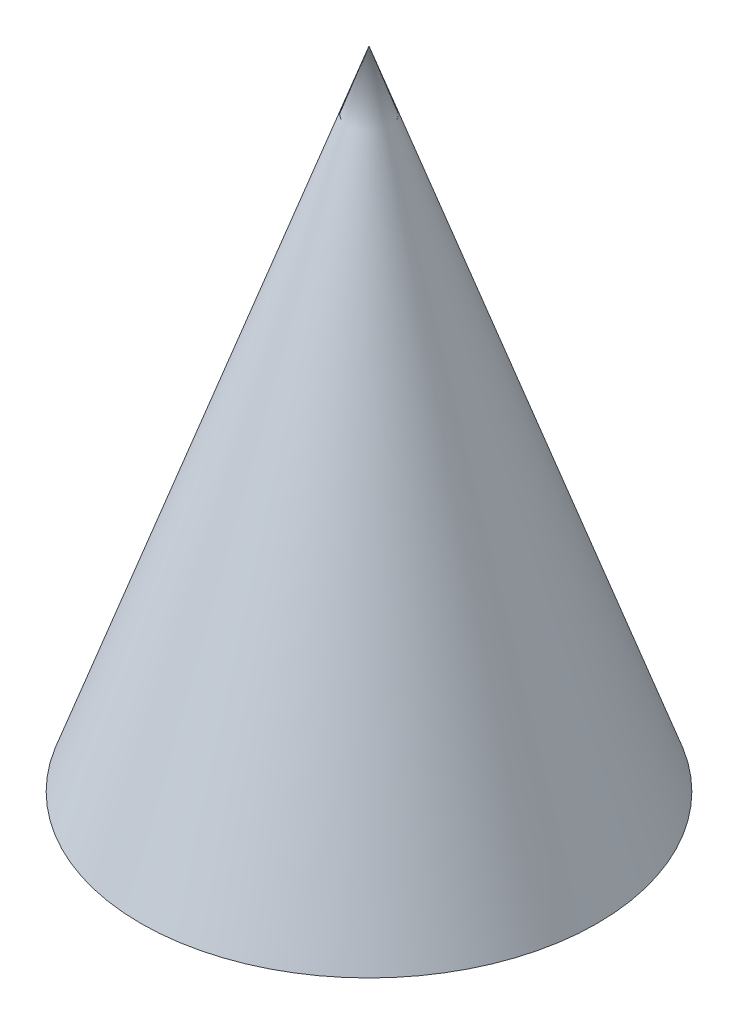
ISO-10303-21;
HEADER;
FILE_DESCRIPTION(('STEP AP214'),'2;1');
FILE_NAME('part.step','',(''),(''),'','','');
FILE_SCHEMA(('AUTOMOTIVE_DESIGN { 1 0 10303 214 1 1 1 1 }'));
ENDSEC;
DATA;
#1=APPLICATION_CONTEXT('core data for automotive mechanical design processes');
#2=APPLICATION_PROTOCOL_DEFINITION('international standard','automotive_design',2000,#1);
#3=PRODUCT_CONTEXT('',#1,'mechanical');
#4=PRODUCT('Part','Part','',(#3));
#5=PRODUCT_RELATED_PRODUCT_CATEGORY('part','',(#4));
#6=PRODUCT_DEFINITION_FORMATION('','',#4);
#7=PRODUCT_DEFINITION_CONTEXT('part definition',#1,'design');
#8=PRODUCT_DEFINITION('design','',#6,#7);
#9=PRODUCT_DEFINITION_SHAPE('','',#8);
#10=(LENGTH_UNIT() NAMED_UNIT(*) SI_UNIT(.MILLI.,.METRE.));
#11=(NAMED_UNIT(*) PLANE_ANGLE_UNIT() SI_UNIT($,.RADIAN.));
#12=(NAMED_UNIT(*) SI_UNIT($,.STERADIAN.) SOLID_ANGLE_UNIT());
#13=UNCERTAINTY_MEASURE_WITH_UNIT(LENGTH_MEASURE(1.E-05),#10,'distance_accuracy_value','');
#14=(GEOMETRIC_REPRESENTATION_CONTEXT(3) GLOBAL_UNCERTAINTY_ASSIGNED_CONTEXT((#13)) GLOBAL_UNIT_ASSIGNED_CONTEXT((#10,
#11,#12)) REPRESENTATION_CONTEXT('',''));
#15=CARTESIAN_POINT('',(0.,0.,0.));
#16=DIRECTION('',(0.,0.,1.));
#17=DIRECTION('',(1.,0.,0.));
#18=AXIS2_PLACEMENT_3D('',#15,#16,#17);
#19=CARTESIAN_POINT('',(0.,53.9096108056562,0.));
#20=DIRECTION('',(0.,-1.,0.));
#21=DIRECTION('',(0.,0.,-1.));
#22=AXIS2_PLACEMENT_3D('',#19,#20,#21);
#23=CONICAL_SURFACE('',#22,0.,0.339836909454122);
#24=CARTESIAN_POINT('',(0.,-2.65893168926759,0.));
#25=DIRECTION('',(0.,1.,0.));
#26=DIRECTION('',(0.,0.,1.));
#27=AXIS2_PLACEMENT_3D('',#24,#25,#26);
#28=CIRCLE('',#27,20.);
#29=CARTESIAN_POINT('',(0.,-2.65893168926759,20.));
#30=VERTEX_POINT('',#29);
#31=EDGE_CURVE('E11',#30,#30,#28,.T.);
#32=ORIENTED_EDGE('',*,*,#31,.T.);
#33=EDGE_LOOP('',(#32));
#34=FACE_BOUND('',#33,.T.);
#35=CARTESIAN_POINT('',(0.,53.9096108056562,0.));
#36=VERTEX_POINT('',#35);
#37=VERTEX_LOOP('',#36);
#38=FACE_BOUND('',#37,.T.);
#39=ADVANCED_FACE('F31',(#34,#38),#23,.T.);
#40=CARTESIAN_POINT('',(-20.,-2.65893168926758,0.));
#41=DIRECTION('',(0.,-1.,0.));
#42=DIRECTION('',(0.,0.,-1.));
#43=AXIS2_PLACEMENT_3D('',#40,#41,#42);
#44=PLANE('',#43);
#45=ORIENTED_EDGE('',*,*,#31,.F.);
#46=EDGE_LOOP('',(#45));
#47=FACE_BOUND('',#46,.T.);
#48=ADVANCED_FACE('F39',(#47),#44,.T.);
#49=CLOSED_SHELL('',(#39,#48));
#50=MANIFOLD_SOLID_BREP('B2',#49);
#51=ADVANCED_BREP_SHAPE_REPRESENTATION('',(#18,#50),#14);
#52=SHAPE_DEFINITION_REPRESENTATION(#9,#51);
ENDSEC;
END-ISO-10303-21;
